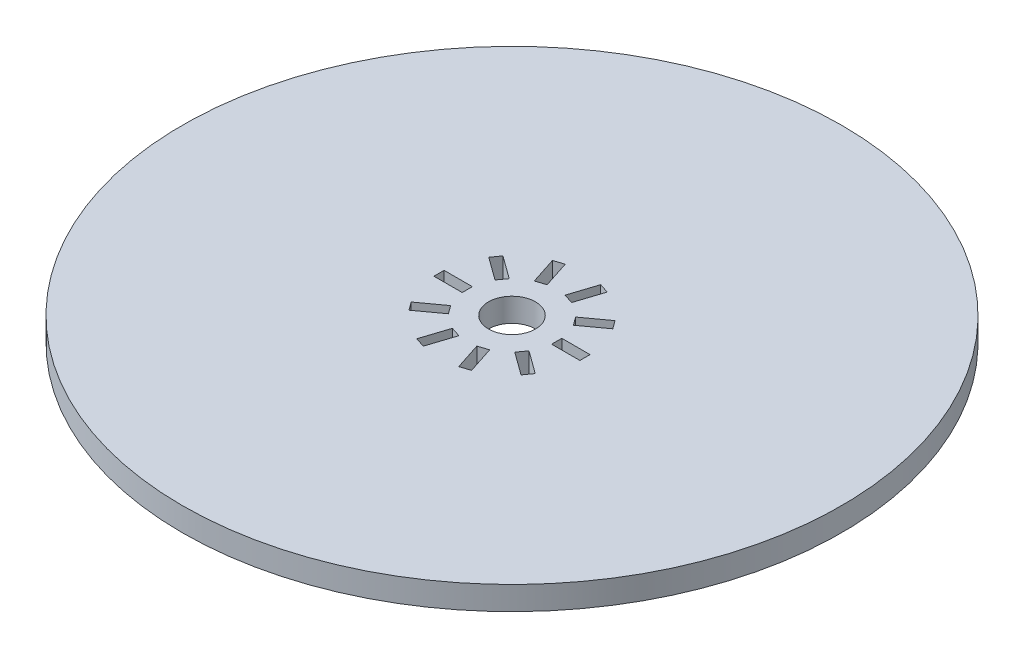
from build123d import *

# Parameters (mm, degrees)
SKETCH1_R           = 88.9
SKETCH1_R_2         = 6.35
BOSS_EXTRUDE1_DEPTH = 6.35
SKETCH2_W           = 7.62
SKETCH2_H           = 2.7432
CUT_EXTRUDE1_DEPTH  = 6.35


with BuildPart() as part:
    # Sketch1 → Boss-Extrude1 (new body)
    with BuildSketch(Plane(origin=(0, 0, 0), x_dir=(1, 0, 0), z_dir=(0, 1, 0))):
        with Locations(Location((0, 0, 0), (0, 0, 270))):
            Circle(SKETCH1_R)
        with Locations(Location((0, 0, 0), (0, 0, 270))):
            Circle(SKETCH1_R_2, mode=Mode.SUBTRACT)
    extrude(amount=BOSS_EXTRUDE1_DEPTH)

    # Sketch2 → Cut-Extrude1 (cut)
    with BuildSketch(Plane(origin=(0, 6.35, 0), x_dir=(1, 0, 0), z_dir=(0, 1, 0))):
        Polygon((10.566996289, -5.981981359), (16.731705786, -10.460904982), (15.119293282, -12.680200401), (8.954583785, -8.201276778), align=None)
        with Locations((15.875, 0)):
            Rectangle(SKETCH2_W, SKETCH2_H)
        Polygon((5.032759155, -11.05064916), (7.387468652, -18.297699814), (4.778530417, -19.145395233), (2.423820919, -11.898344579), align=None)
        Polygon((-2.423820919, -11.898344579), (-4.778530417, -19.145395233), (-7.387468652, -18.297699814), (-5.032759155, -11.05064916), align=None)
        Polygon((-8.954583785, -8.201276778), (-15.119293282, -12.680200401), (-16.731705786, -10.460904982), (-10.566996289, -5.981981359), align=None)
        with Locations((-15.875, 0)):
            Rectangle(SKETCH2_W, SKETCH2_H)
        Polygon((-10.566996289, 5.981981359), (-16.731705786, 10.460904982), (-15.119293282, 12.680200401), (-8.954583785, 8.201276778), align=None)
        Polygon((-5.032759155, 11.05064916), (-7.387468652, 18.297699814), (-4.778530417, 19.145395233), (-2.423820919, 11.898344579), align=None)
        Polygon((2.423820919, 11.898344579), (4.778530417, 19.145395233), (7.387468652, 18.297699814), (5.032759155, 11.05064916), align=None)
        Polygon((8.954583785, 8.201276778), (15.119293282, 12.680200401), (16.731705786, 10.460904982), (10.566996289, 5.981981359), align=None)
    extrude(amount=-CUT_EXTRUDE1_DEPTH, mode=Mode.SUBTRACT)


solid = part.part
